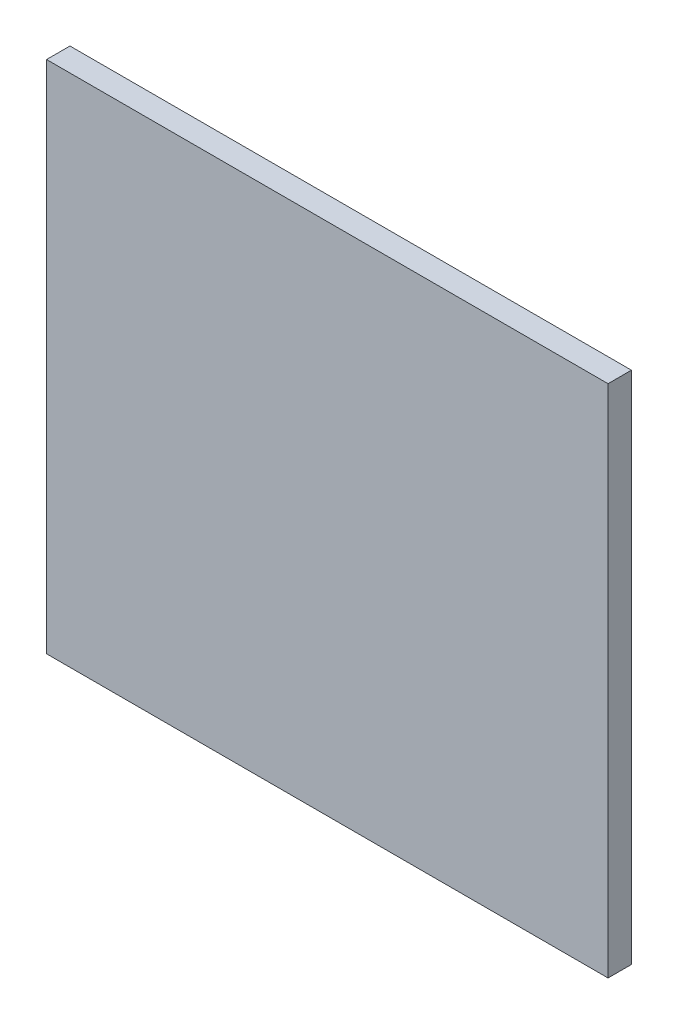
from build123d import *

# Parameters (mm, degrees)
SKETCH1_W           = 1219.2
SKETCH1_H           = 1117.6
BOSS_EXTRUDE2_DEPTH = 50.8


with BuildPart() as part:
    # Sketch1 → Boss-Extrude2 (new body)
    with BuildSketch(Plane.XY):
        with Locations((609.6, 558.8)):
            Rectangle(SKETCH1_W, SKETCH1_H)
    extrude(amount=BOSS_EXTRUDE2_DEPTH)


solid = part.part
